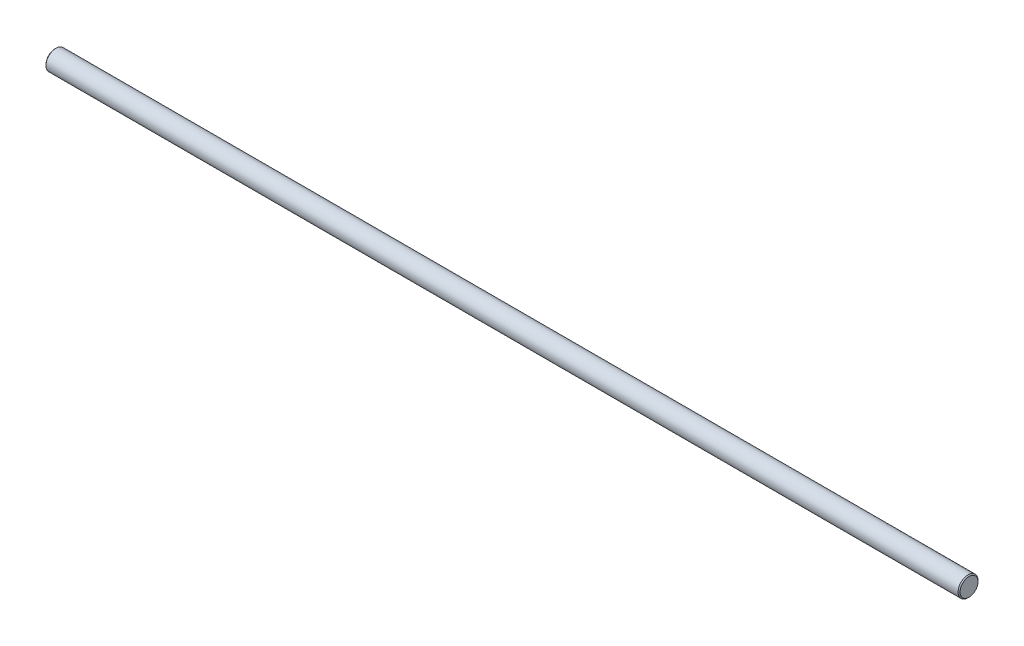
from build123d import *


with BuildPart() as part:
    # Sketch1 → Revolve1 (revolve)
    with BuildSketch(Plane.XY, mode=Mode.PRIVATE) as revolve1_sk:
        Polygon((0, 0), (0, 4.5), (0.5, 5), (457.5, 5), (458, 4.5), (458, 0), align=None)
    revolve(revolve1_sk.sketch.rotate(Axis((458, 0, 0), (-1, 0, 0)), 270), axis=Axis((458, 0, 0), (-1, 0, 0)))


solid = part.part
